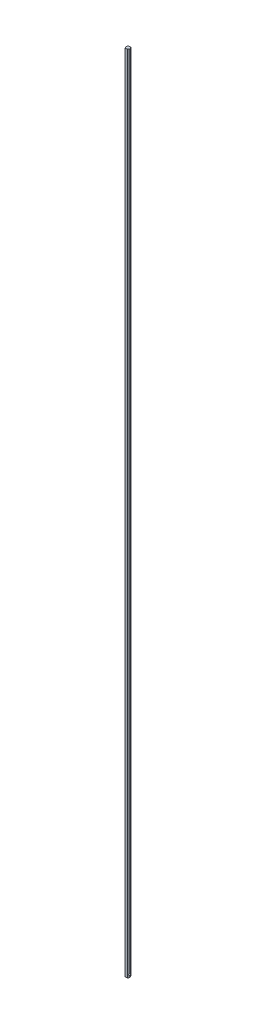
from build123d import *

# Parameters (mm, degrees)
BOSS_EXTRUDE1_DEPTH     = 4550
CUT_EXTRUDE1_DEPTH      = 4551.025640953
CUT_EXTRUDE1_DEPTH_BACK = 4551.025640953
SKETCH6_R               = 5


with BuildPart() as part:
    # Sketch1 → Boss-Extrude1 (new body)
    with BuildSketch(Plane(origin=(0, 0, 0), x_dir=(1, 0, 0), z_dir=(0, 1, 0))):
        Polygon((11.547005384, 0), (5.773502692, 10), (-5.773502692, 10), (-11.547005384, 0), (-5.773502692, -10), (5.773502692, -10), align=None)
    extrude(amount=BOSS_EXTRUDE1_DEPTH)

    # Sketch6 → Cut-Extrude1 (cut, two sides: drawn at the far end of the back side and taken through both)
    with BuildSketch(Plane.ZY.offset(-CUT_EXTRUDE1_DEPTH_BACK)):
        with Locations(Location((0, 15, 0), (0, 0, 90))):
            Circle(SKETCH6_R)
    extrude(amount=CUT_EXTRUDE1_DEPTH + CUT_EXTRUDE1_DEPTH_BACK, mode=Mode.SUBTRACT)


solid = part.part
